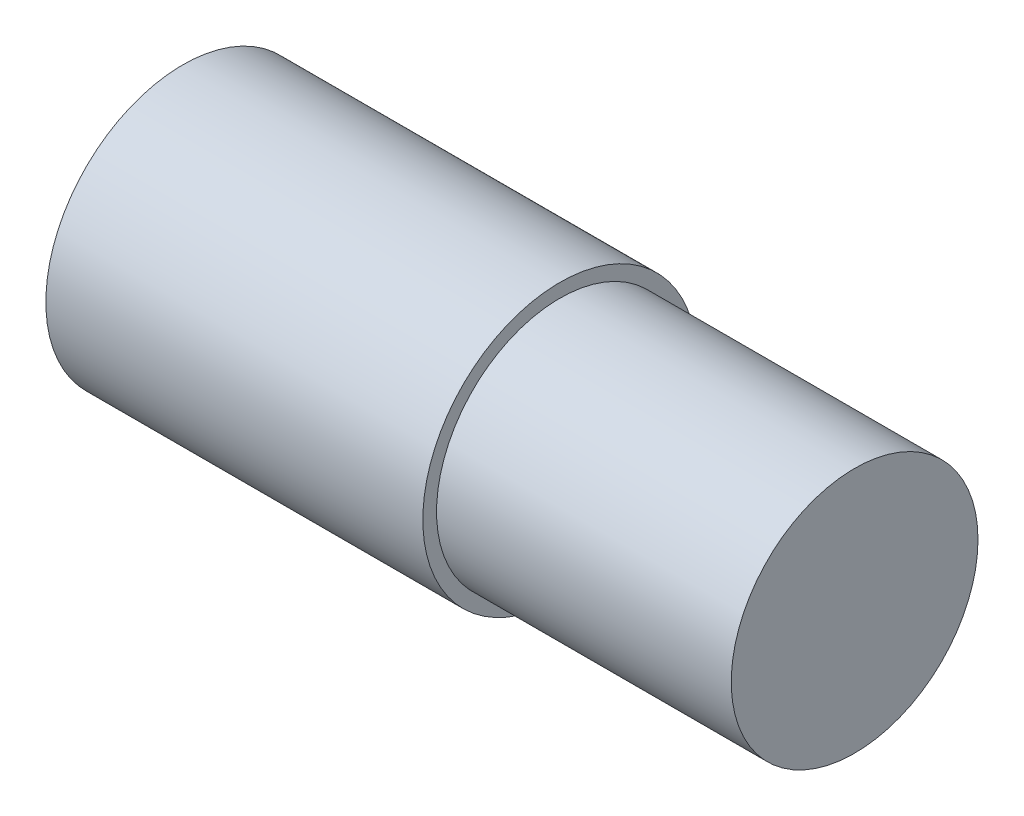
from build123d import *

# Parameters (mm, degrees)
SKETCH1_R           = 200
BOSS_EXTRUDE1_DEPTH = 550
SKETCH2_R           = 60
BOSS_EXTRUDE2_DEPTH = 800
SKETCH3_R           = 180
BOSS_EXTRUDE3_DEPTH = 980


with BuildPart() as part:
    # Sketch1 → Boss-Extrude1 (new body)
    with BuildSketch(Plane(origin=(0, 0, 0), x_dir=(0, 0, -1), z_dir=(1, 0, 0))):
        Circle(SKETCH1_R)
    extrude(amount=BOSS_EXTRUDE1_DEPTH)

    # Sketch2 → Boss-Extrude2 (add)
    with BuildSketch(Plane(origin=(0, 0, 0), x_dir=(0, 0, -1), z_dir=(1, 0, 0))):
        Circle(SKETCH2_R)
    extrude(amount=BOSS_EXTRUDE2_DEPTH)

    # Sketch3 → Boss-Extrude3 (add)
    with BuildSketch(Plane(origin=(0, 0, 0), x_dir=(0, 0, -1), z_dir=(1, 0, 0))):
        Circle(SKETCH3_R)
    extrude(amount=BOSS_EXTRUDE3_DEPTH)


solid = part.part
